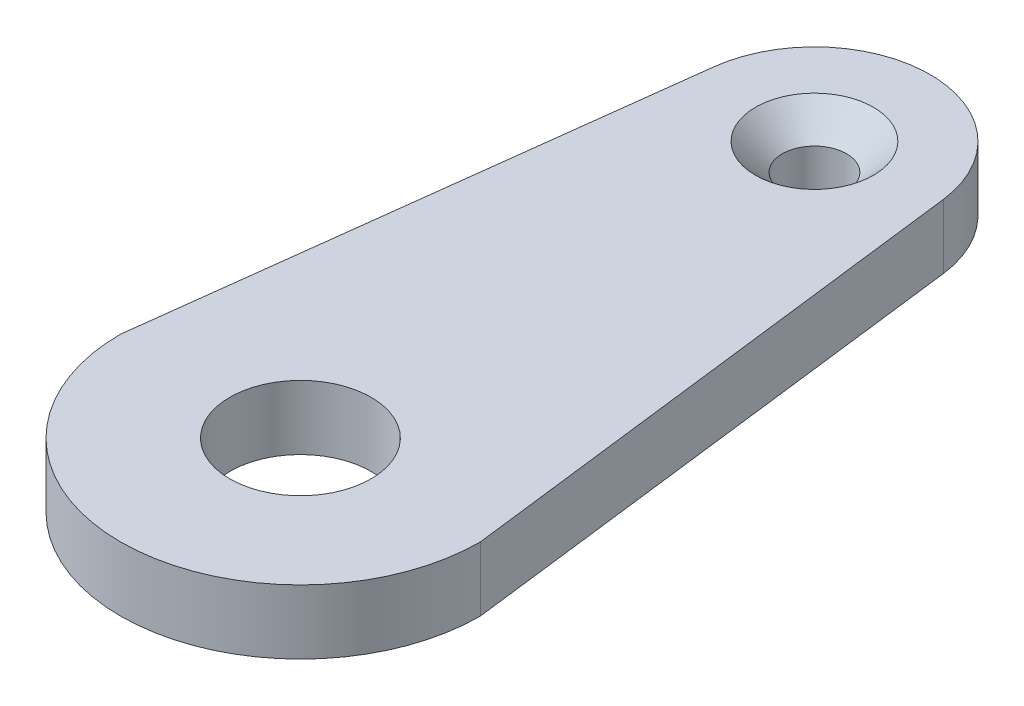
from build123d import *

# Parameters (mm, degrees)
SKETCH1_R                                            = 2.5
SKETCH1_R_2                                          = 5.5
BOSS_EXTRUDE1_DEPTH                                  = 5
CUT_EXTRUDE2_DEPTH                                   = 57.00892786
CSK_FOR_M4_HEX_SOCKET_COUNTERSUNK_HEAD_S_D           = 4.5
CSK_FOR_M4_HEX_SOCKET_COUNTERSUNK_HEAD_S_CSINK_D     = 9.18
CSK_FOR_M4_HEX_SOCKET_COUNTERSUNK_HEAD_S_CSINK_ANGLE = 90


with BuildPart() as part:
    # Sketch1 → Boss-Extrude1 (new body)
    with BuildSketch(Plane(origin=(0, 0, 0), x_dir=(1, 0, 0), z_dir=(0, 1, 0))):
        with BuildLine():
            Line((-14, 0), (-14, 40))
            ThreePointArc((-14, 40), (0, 54), (14, 40))
            Line((14, 40), (14, 0))
            ThreePointArc((14, 0), (0, -14), (-14, 0))
        make_face()
        with Locations(Location((0, 40, 0), (0, 0, 270))):
            Circle(SKETCH1_R, mode=Mode.SUBTRACT)
        with Locations(Location((0, 0, 0), (0, 0, 270))):
            Circle(SKETCH1_R_2, mode=Mode.SUBTRACT)
    extrude(amount=BOSS_EXTRUDE1_DEPTH)

    # Sketch3 → Cut-Extrude2 (cut, through all)
    with BuildSketch(Plane(origin=(0, 5, 0), x_dir=(1, 0, 0), z_dir=(0, 1, 0))):
        with BuildLine():
            Line((-14, 40), (-14, 0))
            Line((-14, 0), (-8.932361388, 41.101326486))
            ThreePointArc((-8.932361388, 41.101326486), (0, 49), (8.932361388, 41.101326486))
            Line((8.932361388, 41.101326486), (14, 0))
            Line((14, 0), (14, 40))
            ThreePointArc((14, 40), (0, 54), (-14, 40))
        make_face()
    extrude(amount=-CUT_EXTRUDE2_DEPTH, mode=Mode.SUBTRACT)

    # CSK for M4 Hex Socket Countersunk Head S (through all)
    with Locations(Plane(origin=(0, 5, 0), x_dir=(1, 0, 0), z_dir=(0, 1, 0))):
        with Locations((0, 40)):
            CounterSinkHole(CSK_FOR_M4_HEX_SOCKET_COUNTERSUNK_HEAD_S_D / 2, CSK_FOR_M4_HEX_SOCKET_COUNTERSUNK_HEAD_S_CSINK_D / 2, counter_sink_angle=CSK_FOR_M4_HEX_SOCKET_COUNTERSUNK_HEAD_S_CSINK_ANGLE)


solid = part.part
